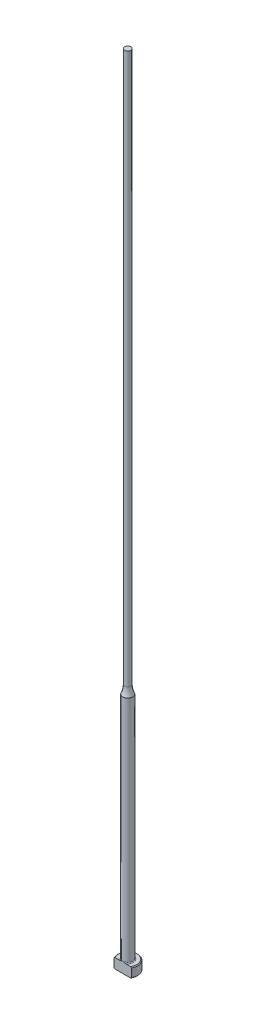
from build123d import *

# Parameters (mm, degrees)
CHAMFER1_SIZE = 0.254
FILLET1_R     = 0.254
KEY_DEPTH     = 255.0396844


with BuildPart() as part:
    # Sketch1 → Revolve1 (revolve)
    with BuildSketch(Plane.XY, mode=Mode.PRIVATE) as revolve1_sk:
        with BuildLine():
            Line((0, 0), (-3.175, 0))
            Line((-3.175, 0), (-3.175, 3.175))
            Line((-3.175, 3.175), (-1.5875, 3.175))
            Line((-1.5875, 3.175), (-1.5875, 76.2))
            ThreePointArc((-1.5875, 76.2), (-1.142565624, 77.509911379), (-0.99187, 78.885093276))
            Line((-0.99187, 78.885093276), (-0.99187, 254))
            Line((-0.99187, 254), (0, 254))
            Line((0, 254), (0, 0))
        make_face()
    revolve(revolve1_sk.sketch.rotate(Axis((0, 259.958771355, 0), (0, -1, 0)), 270), axis=Axis((0, 259.958771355, 0), (0, -1, 0)))

    # Chamfer1
    chamfer1_edges = [part.edges().sort_by_distance(p)[0] for p in [
        (0, 0, -3.175),
        (0, 3.175, -3.175),
    ]]
    chamfer(chamfer1_edges, length=CHAMFER1_SIZE)

    # Fillet1
    fillet1_edges = [part.edges().sort_by_distance(p)[0] for p in [
        (0, 3.175, -1.5875),
    ]]
    fillet(fillet1_edges, radius=FILLET1_R)

    # Sketch2 → KEY (cut, through all)
    with BuildSketch(Plane.XZ):
        with BuildLine():
            Line((-2.749630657, 1.5875), (2.749630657, 1.5875))
            ThreePointArc((2.749630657, 1.5875), (0, 3.175), (-2.749630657, 1.5875))
        make_face()
    extrude(amount=-KEY_DEPTH, mode=Mode.SUBTRACT)


solid = part.part
